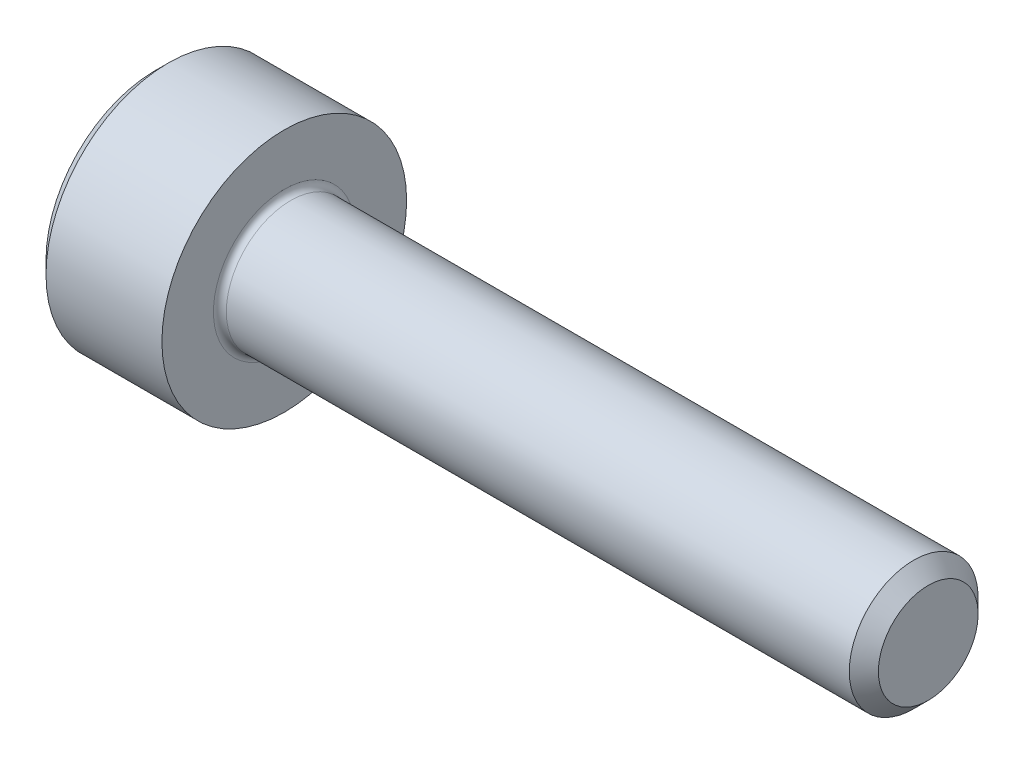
from build123d import *

# Parameters (mm, degrees)
FILLET1_R   = 0.1
HEX_2_DEPTH = 1


with BuildPart() as part:
    # BodySke → Base-Revolve (revolve)
    with BuildSketch(Plane.XY, mode=Mode.PRIVATE) as base_revolve_sk:
        Polygon((0, 0), (0, 1.7), (0.2, 1.9), (2, 1.9), (2, 1), (11.774, 1), (12, 0.774), (12, 0), align=None)
    revolve(base_revolve_sk.sketch.rotate(Axis((-31.75, 0, 0), (1, 0, 0)), 90), axis=Axis((-31.75, 0, 0), (1, 0, 0)))

    # Fillet1
    fillet1_edges = [part.edges().sort_by_distance(p)[0] for p in [
        (2, 0, -1),
    ]]
    fillet(fillet1_edges, radius=FILLET1_R)

    # Sketch2 → Hex-PreBroach (revolve, cut)
    with BuildSketch(Plane.XY, mode=Mode.PRIVATE) as hex_prebroach_sk:
        Polygon((0, 0.7725), (1, 0.7725), (1.446003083, 0), (0, 0), align=None)
    revolve(hex_prebroach_sk.sketch.rotate(Axis((0, 0, 0), (1, 0, 0)), 90), axis=Axis((0, 0, 0), (1, 0, 0)), mode=Mode.SUBTRACT)

    # Sketch3 → Hex 2 (cut)
    with BuildSketch(Plane(origin=(0, 0, 0), x_dir=(0, 0.500000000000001, 0.866025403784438), z_dir=(-1, 0, 0))):
        Polygon((0.446003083, 0.7725), (-0.446003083, 0.7725), (-0.892006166, 0), (-0.446003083, -0.7725), (0.446003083, -0.7725), (0.892006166, 0), align=None)
    extrude(amount=-HEX_2_DEPTH, mode=Mode.SUBTRACT)


solid = part.part
